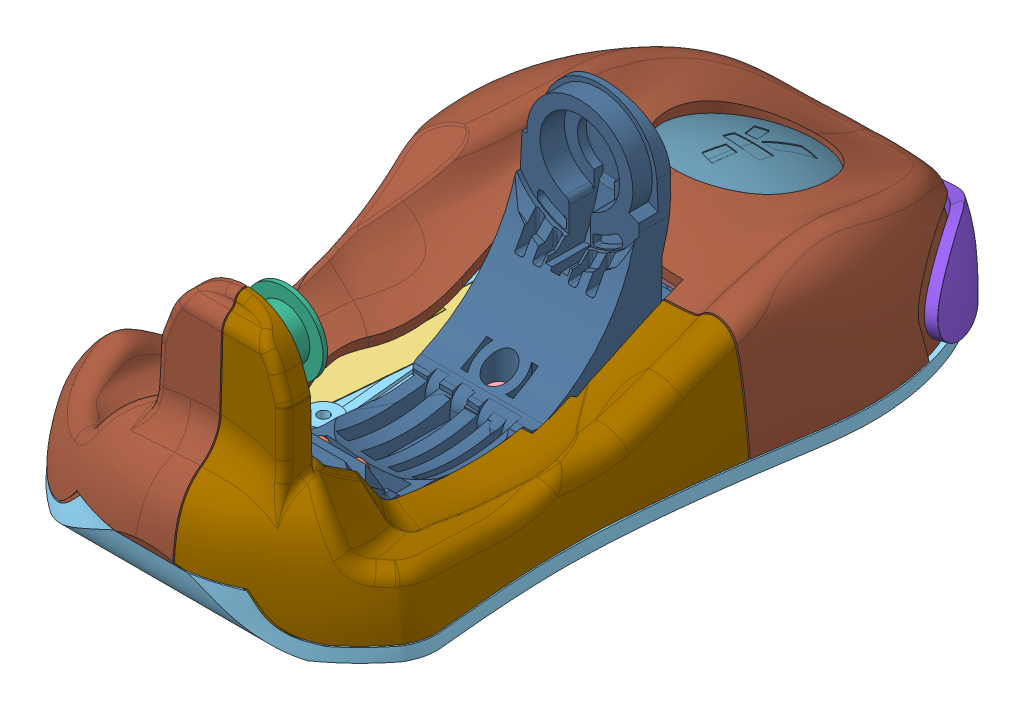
SolidWorks assembly Left_Foot_jambe droite.sldasm, configuration Défaut (file format 9000). Lengths in mm.
Overall size (106.44 58.71 171.69).
26 component instances, 15 part files, 0 mates.
Components (placement in the parent):
- STD_M850001__P_Scotch_double_Face_3M_5419_Default-1: STD_M850001__P_Scotch_double_Face_3M_5419_Default.sldprt [Default] at (-23.9002 -40.8442 -61.9998) x (0 0 -1) z (0 1 0) size (13 10 0.25)
- STD_M700004__PZ99_KA22x8_KA22 x 8-1: STD_M700004__PZ99_KA22x8_KA22 x 8.sldprt [Default] at (-16.4 -30.0842 45.1) x (0 1 0) z (-0.943584 0 -0.331134) size (9.5 3.9 3.91)
- STD_M850001__P_Scotch_double_Face_3M_5419_Default-2: STD_M850001__P_Scotch_double_Face_3M_5419_Default.sldprt [Default] at (27.1002 -40.5942 -74.9998) x (0 0 1) z (0 -1 0) size (13 10 0.25)
- STD_E990013__P_FSR_4P-1: STD_E990013__P_FSR_4P.sldprt [Default] at (19.0956 -40.8442 30.9044) x (0 0 1) z (0 -1 0) size (108.1 14 0.37)
- STD_M700004__PZ99_KA22x8_KA22 x 8-2: STD_M700004__PZ99_KA22x8_KA22 x 8.sldprt [Default] at (13.2 -30.0842 45.1) x (0 1 0) z (-0.676128 0 -0.736784) size (9.5 3.9 3.91)
- STD_M830010__P_Axial_Magnet_6x3_Default-1: STD_M830010__P_Axial_Magnet_6x3_Default.sldprt [Default] at (-0.0436 -43.3342 -16.4801) x (0.495785 0 -0.868445) z (0 1 0) size (6 6 3.01)
- ALD_M010097__P_semelle_gauche_default-1: ALD_M010097__P_semelle_gauche_default.sldprt [Default] at (0 -45.0842 21.6) x (0 0 -1) z (0 1 0) size (171.69 106.44 28.07)
- STD_M850001__P_Scotch_double_Face_3M_5419_Default-3: STD_M850001__P_Scotch_double_Face_3M_5419_Default.sldprt [Default] at (-24.4459 -40.8442 37.9999) x (0.087156 0 -0.996195) z (0 1 0) size (13 10 0.25)
- STD_M510003__P_palier_GFM_1012-07_stabdard-1: STD_M510003__P_palier_GFM_1012-07_stabdard.sldprt [Default] at (0 0 31.4) x (0 0 1) z (-0.219796 0.975546 0) size (7 18 18)
- STD_M850001__P_Scotch_double_Face_3M_5419_Default-4: STD_M850001__P_Scotch_double_Face_3M_5419_Default.sldprt [Default] at (13.1002 -40.8442 36.8998) x (1 0 0) z (0 1 0) size (13 10 0.25)
- STD_E990012__P_FSR_2P_pli 4-1: STD_E990012__P_FSR_2P_pli 4.sldprt [Default] at (23.0956 -40.8442 -69.0044) x (0 0 -1) z (0 -1 0) size (57.3 20.1 4.54)
- ALD_M010101__P_bumper_pied_gauche_A-1: ALD_M010101__P_bumper_pied_gauche_A.sldprt [Default] at (-0.0116 -45.2942 21.6078) x (0 0 -1) z (0 1 0) size (33.01 78.09 20.91)
- ALD_M010133__P_coque_interieure_pied_gauche-1: ALD_M010133__P_coque_interieure_pied_gauche.sldprt [Default] at (0 -45.0842 21.6) x (0 0 -1) z (0 1 0) size (104.04 41.95 56.84)
- STD_M700004__PZ99_KA22x8_KA22 x 8-3: STD_M700004__PZ99_KA22x8_KA22 x 8.sldprt [Default] at (-4.25 -31.212 18.3352) x (0 0 1) z (0.021347 -0.999772 0) size (9.5 3.9 3.91)
- ALD_M010099__P_structure_pied_gauche_default-1: ALD_M010099__P_structure_pied_gauche_default.sldprt [Default] at (-6.6116 -41.5942 -17.9596) x (0 1 0) z (0 0 -1) size (54.34 78.21 137.68)
- STD_M700004__PZ99_KA22x8_KA22 x 8-4: STD_M700004__PZ99_KA22x8_KA22 x 8.sldprt [Default] at (4.25 -31.212 18.3521) x (0 0 1) z (0.183952 -0.982935 0) size (9.5 3.9 3.91)
- ALD_M010018__P_support_dente_A08-1: ALD_M010018__P_support_dente_A08.sldprt [Default] at (0 0 31.2) x (0 0 -1) z (-1 0 0) size (20.4 48.62 27.24)
- STD_M700004__PZ99_KA22x8_KA22 x 8-5: STD_M700004__PZ99_KA22x8_KA22 x 8.sldprt [Default] at (26.7 -30.0842 -81.8) x (0 1 0) z (-0.96573 0 -0.25955) size (9.5 3.9 3.91)
- STD_M700004__PZ99_KA22x8_KA22 x 8-6: STD_M700004__PZ99_KA22x8_KA22 x 8.sldprt [Default] at (-31.7 -35.0842 -81.8) x (0 1 0) z (-0.841418 0 -0.540385) size (9.5 3.9 3.91)
- STD_M830010__P_Axial_Magnet_6x3_Default-2: STD_M830010__P_Axial_Magnet_6x3_Default.sldprt [Default] at (-0.0436 -39.0942 -16.4801) x (-0.919248 0 0.393679) z (0 1 0) size (6 6 3.01)
- ALD_M010131__P_coque_exterieure_pied_gauche_A02-1: ALD_M010131__P_coque_exterieure_pied_gauche_A02.SLDPRT [Default] at (0 -45.0842 21.6) x (0 0 -1) z (0 1 0) size (164.58 94 58.48)
- STD_E990013__P_FSR_4P-2: STD_E990013__P_FSR_4P.sldprt [Default] at (-29.896 -40.8442 31.5047) x (-0.087156 0 0.996195) z (0 -1 0) size (108.1 14 0.37)
- ALD_E000030__P_carte_MRE-1: ALD_E000030__P_carte_MRE.sldprt [Default] at (10 10 41.9) x (0 -1 0) z (0 0 -1) size (18.94 18.94 5)
- STD_E990012__P_FSR_2P_pli 4-2: STD_E990012__P_FSR_2P_pli 4.sldprt [Default] at (-29.8956 -40.8442 -69.0068) x (0 0 -1) z (0 -1 0) size (57.3 20.1 4.54)
- ALD_E000032__P_Carte_Moteur_Pied_A00-1: ALD_E000032__P_Carte_Moteur_Pied_A00.sldprt [Default] at (19.9576 -32.4942 -54.2074) size (53 5.6 34.31)
- FOOT_06-1: FOOT_06.SLDPRT [Default] at (0 -24.8301 -72.2414) x (-1 0 0) z (0 0 -1) size (33.05 11.16 33.17)
